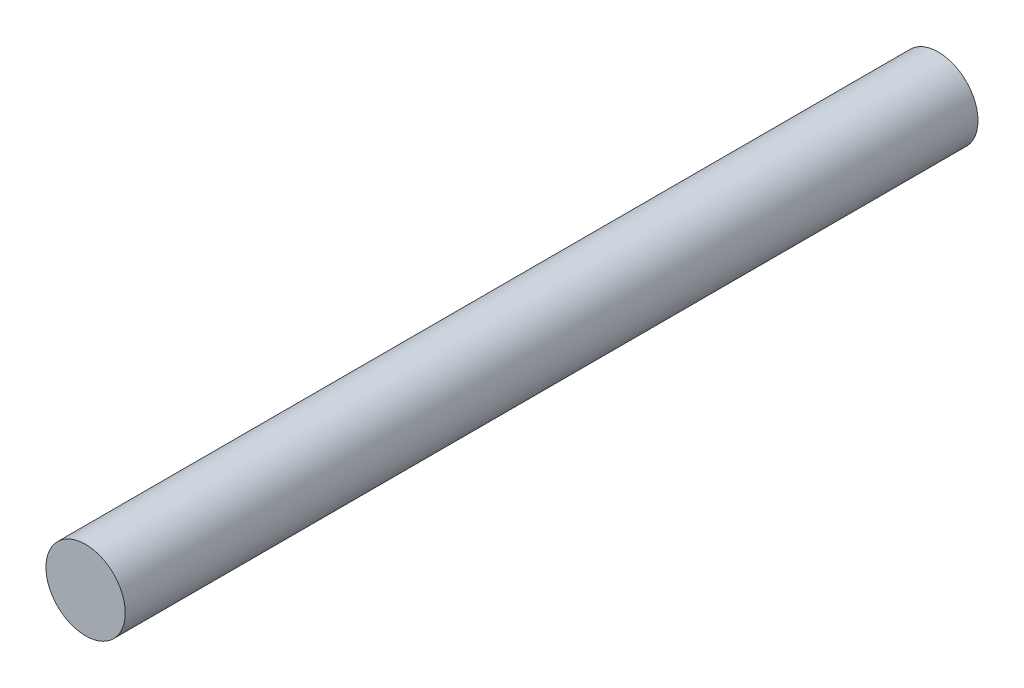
from build123d import *

# Parameters (mm, degrees)
SKETCH_1_R          = 2
EXTRUDE_1_DEPTH     = 21.5
CUT_EXTRUDE_START   = -1
CUT_EXTRUDE_1_DEPTH = 20


with BuildPart() as part:
    # Sketch 1 → Extrude 1 (new, symmetric)
    with BuildSketch(Plane.XY):
        Circle(SKETCH_1_R)
    extrude(amount=EXTRUDE_1_DEPTH, both=True)

    # Sketch 2 → Cut-Extrude 1 (cut)
    with BuildSketch(Plane(origin=(0, 0, 0), x_dir=(0, 0, -1), z_dir=(1, 0, 0)).offset(CUT_EXTRUDE_START)):
        with BuildLine():
            Line((-19.5, 0.8), (-15.5, 0.8))
            ThreePointArc((-15.5, 0.8), (-14.7, 0), (-15.5, -0.8))
            Line((-15.5, -0.8), (-19.5, -0.8))
            ThreePointArc((-19.5, -0.8), (-20.3, 0), (-19.5, 0.8))
        make_face()
    cut_extrude_1 = extrude(amount=-CUT_EXTRUDE_1_DEPTH, mode=Mode.SUBTRACT)

    # Mirror 1: Cut-Extrude 1 across plane
    add(cut_extrude_1.mirror(Plane.XY), mode=Mode.SUBTRACT)


solid = part.part
